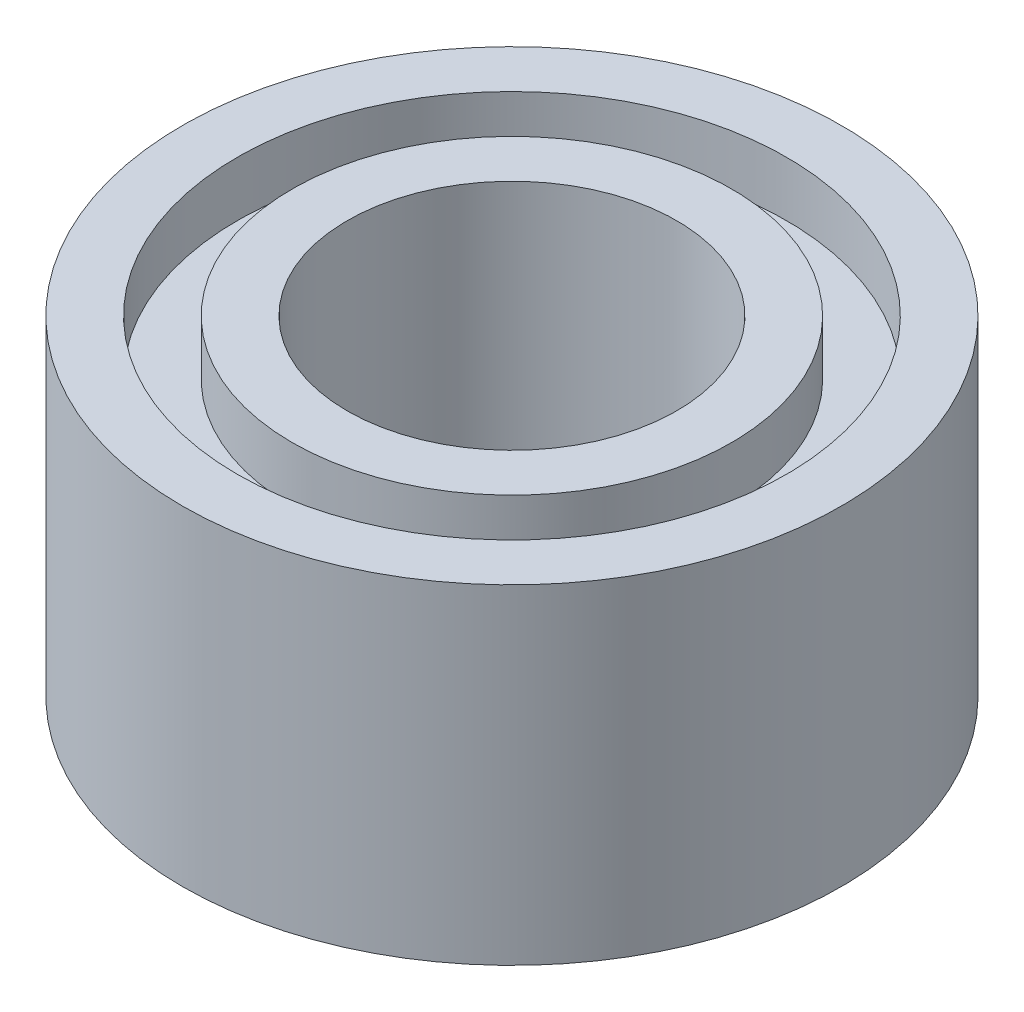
ISO-10303-21;
HEADER;
FILE_DESCRIPTION(('STEP AP214'),'2;1');
FILE_NAME('part.step','',(''),(''),'','','');
FILE_SCHEMA(('AUTOMOTIVE_DESIGN { 1 0 10303 214 1 1 1 1 }'));
ENDSEC;
DATA;
#1=APPLICATION_CONTEXT('core data for automotive mechanical design processes');
#2=APPLICATION_PROTOCOL_DEFINITION('international standard','automotive_design',2000,#1);
#3=PRODUCT_CONTEXT('',#1,'mechanical');
#4=PRODUCT('Part','Part','',(#3));
#5=PRODUCT_RELATED_PRODUCT_CATEGORY('part','',(#4));
#6=PRODUCT_DEFINITION_FORMATION('','',#4);
#7=PRODUCT_DEFINITION_CONTEXT('part definition',#1,'design');
#8=PRODUCT_DEFINITION('design','',#6,#7);
#9=PRODUCT_DEFINITION_SHAPE('','',#8);
#10=(LENGTH_UNIT() NAMED_UNIT(*) SI_UNIT(.MILLI.,.METRE.));
#11=(NAMED_UNIT(*) PLANE_ANGLE_UNIT() SI_UNIT($,.RADIAN.));
#12=(NAMED_UNIT(*) SI_UNIT($,.STERADIAN.) SOLID_ANGLE_UNIT());
#13=UNCERTAINTY_MEASURE_WITH_UNIT(LENGTH_MEASURE(1.E-05),#10,'distance_accuracy_value','');
#14=(GEOMETRIC_REPRESENTATION_CONTEXT(3) GLOBAL_UNCERTAINTY_ASSIGNED_CONTEXT((#13)) GLOBAL_UNIT_ASSIGNED_CONTEXT((#10,
#11,#12)) REPRESENTATION_CONTEXT('',''));
#15=CARTESIAN_POINT('',(0.,0.,0.));
#16=DIRECTION('',(0.,0.,1.));
#17=DIRECTION('',(1.,0.,0.));
#18=AXIS2_PLACEMENT_3D('',#15,#16,#17);
#19=CARTESIAN_POINT('',(0.,0.,0.));
#20=DIRECTION('',(0.,1.,0.));
#21=DIRECTION('',(0.,0.,1.));
#22=AXIS2_PLACEMENT_3D('',#19,#20,#21);
#23=PLANE('',#22);
#24=CARTESIAN_POINT('',(0.,0.,0.));
#25=DIRECTION('',(0.,1.,0.));
#26=DIRECTION('',(0.,0.,1.));
#27=AXIS2_PLACEMENT_3D('',#24,#25,#26);
#28=CIRCLE('',#27,1.5);
#29=CARTESIAN_POINT('',(0.,0.,1.5));
#30=VERTEX_POINT('',#29);
#31=EDGE_CURVE('E58',#30,#30,#28,.T.);
#32=ORIENTED_EDGE('',*,*,#31,.T.);
#33=EDGE_LOOP('',(#32));
#34=FACE_BOUND('',#33,.T.);
#35=CARTESIAN_POINT('',(0.,0.,0.));
#36=DIRECTION('',(0.,-1.,0.));
#37=DIRECTION('',(0.,0.,-1.));
#38=AXIS2_PLACEMENT_3D('',#35,#36,#37);
#39=CIRCLE('',#38,2.);
#40=CARTESIAN_POINT('',(0.,0.,-2.));
#41=VERTEX_POINT('',#40);
#42=EDGE_CURVE('E82',#41,#41,#39,.T.);
#43=ORIENTED_EDGE('',*,*,#42,.T.);
#44=EDGE_LOOP('',(#43));
#45=FACE_BOUND('',#44,.T.);
#46=ADVANCED_FACE('F45',(#34,#45),#23,.F.);
#47=CARTESIAN_POINT('',(0.,3.,0.));
#48=DIRECTION('',(0.,1.,0.));
#49=DIRECTION('',(0.,0.,1.));
#50=AXIS2_PLACEMENT_3D('',#47,#48,#49);
#51=PLANE('',#50);
#52=CARTESIAN_POINT('',(0.,3.,0.));
#53=DIRECTION('',(0.,1.,0.));
#54=DIRECTION('',(0.,0.,1.));
#55=AXIS2_PLACEMENT_3D('',#52,#53,#54);
#56=CIRCLE('',#55,1.5);
#57=CARTESIAN_POINT('',(0.,3.,1.5));
#58=VERTEX_POINT('',#57);
#59=EDGE_CURVE('E56',#58,#58,#56,.T.);
#60=ORIENTED_EDGE('',*,*,#59,.F.);
#61=EDGE_LOOP('',(#60));
#62=FACE_BOUND('',#61,.T.);
#63=CARTESIAN_POINT('',(0.,3.,0.));
#64=DIRECTION('',(0.,1.,0.));
#65=DIRECTION('',(0.,0.,1.));
#66=AXIS2_PLACEMENT_3D('',#63,#64,#65);
#67=CIRCLE('',#66,2.);
#68=CARTESIAN_POINT('',(0.,3.,2.));
#69=VERTEX_POINT('',#68);
#70=EDGE_CURVE('E70',#69,#69,#67,.T.);
#71=ORIENTED_EDGE('',*,*,#70,.T.);
#72=EDGE_LOOP('',(#71));
#73=FACE_BOUND('',#72,.T.);
#74=ADVANCED_FACE('F120',(#62,#73),#51,.T.);
#75=CARTESIAN_POINT('',(0.,3.,0.));
#76=DIRECTION('',(0.,1.,0.));
#77=DIRECTION('',(0.,0.,1.));
#78=AXIS2_PLACEMENT_3D('',#75,#76,#77);
#79=CIRCLE('',#78,2.5);
#80=CARTESIAN_POINT('',(0.,3.,2.5));
#81=VERTEX_POINT('',#80);
#82=EDGE_CURVE('E64',#81,#81,#79,.T.);
#83=ORIENTED_EDGE('',*,*,#82,.F.);
#84=EDGE_LOOP('',(#83));
#85=FACE_BOUND('',#84,.T.);
#86=CARTESIAN_POINT('',(0.,3.,0.));
#87=DIRECTION('',(0.,1.,0.));
#88=DIRECTION('',(0.,0.,1.));
#89=AXIS2_PLACEMENT_3D('',#86,#87,#88);
#90=CIRCLE('',#89,3.);
#91=CARTESIAN_POINT('',(0.,3.,3.));
#92=VERTEX_POINT('',#91);
#93=EDGE_CURVE('E10',#92,#92,#90,.T.);
#94=ORIENTED_EDGE('',*,*,#93,.T.);
#95=EDGE_LOOP('',(#94));
#96=FACE_BOUND('',#95,.T.);
#97=ADVANCED_FACE('F107',(#85,#96),#51,.T.);
#98=CARTESIAN_POINT('',(0.,0.,0.));
#99=DIRECTION('',(0.,-1.,0.));
#100=DIRECTION('',(0.,0.,-1.));
#101=AXIS2_PLACEMENT_3D('',#98,#99,#100);
#102=CIRCLE('',#101,2.5);
#103=CARTESIAN_POINT('',(0.,0.,-2.5));
#104=VERTEX_POINT('',#103);
#105=EDGE_CURVE('E76',#104,#104,#102,.T.);
#106=ORIENTED_EDGE('',*,*,#105,.F.);
#107=EDGE_LOOP('',(#106));
#108=FACE_BOUND('',#107,.T.);
#109=CARTESIAN_POINT('',(0.,0.,0.));
#110=DIRECTION('',(0.,1.,0.));
#111=DIRECTION('',(0.,0.,1.));
#112=AXIS2_PLACEMENT_3D('',#109,#110,#111);
#113=CIRCLE('',#112,3.);
#114=CARTESIAN_POINT('',(0.,0.,3.));
#115=VERTEX_POINT('',#114);
#116=EDGE_CURVE('E49',#115,#115,#113,.T.);
#117=ORIENTED_EDGE('',*,*,#116,.F.);
#118=EDGE_LOOP('',(#117));
#119=FACE_BOUND('',#118,.T.);
#120=ADVANCED_FACE('F104',(#108,#119),#23,.F.);
#121=CARTESIAN_POINT('',(0.,3.,0.));
#122=DIRECTION('',(0.,-1.,0.));
#123=DIRECTION('',(0.,0.,-1.));
#124=AXIS2_PLACEMENT_3D('',#121,#122,#123);
#125=CYLINDRICAL_SURFACE('',#124,3.);
#126=ORIENTED_EDGE('',*,*,#93,.F.);
#127=EDGE_LOOP('',(#126));
#128=FACE_BOUND('',#127,.T.);
#129=ORIENTED_EDGE('',*,*,#116,.T.);
#130=EDGE_LOOP('',(#129));
#131=FACE_BOUND('',#130,.T.);
#132=ADVANCED_FACE('F47',(#128,#131),#125,.T.);
#133=CARTESIAN_POINT('',(0.,3.,0.));
#134=DIRECTION('',(0.,-1.,0.));
#135=DIRECTION('',(0.,0.,-1.));
#136=AXIS2_PLACEMENT_3D('',#133,#134,#135);
#137=CYLINDRICAL_SURFACE('',#136,1.5);
#138=ORIENTED_EDGE('',*,*,#59,.T.);
#139=EDGE_LOOP('',(#138));
#140=FACE_BOUND('',#139,.T.);
#141=ORIENTED_EDGE('',*,*,#31,.F.);
#142=EDGE_LOOP('',(#141));
#143=FACE_BOUND('',#142,.T.);
#144=ADVANCED_FACE('F111',(#140,#143),#137,.F.);
#145=CARTESIAN_POINT('',(0.,2.5,0.));
#146=DIRECTION('',(0.,1.,0.));
#147=DIRECTION('',(0.,0.,1.));
#148=AXIS2_PLACEMENT_3D('',#145,#146,#147);
#149=CYLINDRICAL_SURFACE('',#148,2.5);
#150=CARTESIAN_POINT('',(0.,2.5,0.));
#151=DIRECTION('',(0.,1.,0.));
#152=DIRECTION('',(0.,0.,1.));
#153=AXIS2_PLACEMENT_3D('',#150,#151,#152);
#154=CIRCLE('',#153,2.5);
#155=CARTESIAN_POINT('',(0.,2.5,2.5));
#156=VERTEX_POINT('',#155);
#157=EDGE_CURVE('E61',#156,#156,#154,.T.);
#158=ORIENTED_EDGE('',*,*,#157,.F.);
#159=EDGE_LOOP('',(#158));
#160=FACE_BOUND('',#159,.T.);
#161=ORIENTED_EDGE('',*,*,#82,.T.);
#162=EDGE_LOOP('',(#161));
#163=FACE_BOUND('',#162,.T.);
#164=ADVANCED_FACE('F116',(#160,#163),#149,.F.);
#165=CARTESIAN_POINT('',(0.,2.5,0.));
#166=DIRECTION('',(0.,1.,0.));
#167=DIRECTION('',(0.,0.,1.));
#168=AXIS2_PLACEMENT_3D('',#165,#166,#167);
#169=PLANE('',#168);
#170=CARTESIAN_POINT('',(0.,2.5,0.));
#171=DIRECTION('',(0.,1.,0.));
#172=DIRECTION('',(0.,0.,1.));
#173=AXIS2_PLACEMENT_3D('',#170,#171,#172);
#174=CIRCLE('',#173,2.);
#175=CARTESIAN_POINT('',(0.,2.5,2.));
#176=VERTEX_POINT('',#175);
#177=EDGE_CURVE('E67',#176,#176,#174,.T.);
#178=ORIENTED_EDGE('',*,*,#177,.F.);
#179=EDGE_LOOP('',(#178));
#180=FACE_BOUND('',#179,.T.);
#181=ORIENTED_EDGE('',*,*,#157,.T.);
#182=EDGE_LOOP('',(#181));
#183=FACE_BOUND('',#182,.T.);
#184=ADVANCED_FACE('F133',(#180,#183),#169,.T.);
#185=CARTESIAN_POINT('',(0.,2.5,0.));
#186=DIRECTION('',(0.,1.,0.));
#187=DIRECTION('',(0.,0.,1.));
#188=AXIS2_PLACEMENT_3D('',#185,#186,#187);
#189=CYLINDRICAL_SURFACE('',#188,2.);
#190=ORIENTED_EDGE('',*,*,#177,.T.);
#191=EDGE_LOOP('',(#190));
#192=FACE_BOUND('',#191,.T.);
#193=ORIENTED_EDGE('',*,*,#70,.F.);
#194=EDGE_LOOP('',(#193));
#195=FACE_BOUND('',#194,.T.);
#196=ADVANCED_FACE('F100',(#192,#195),#189,.T.);
#197=CARTESIAN_POINT('',(0.,0.5,0.));
#198=DIRECTION('',(0.,-1.,0.));
#199=DIRECTION('',(0.,0.,-1.));
#200=AXIS2_PLACEMENT_3D('',#197,#198,#199);
#201=CYLINDRICAL_SURFACE('',#200,2.5);
#202=CARTESIAN_POINT('',(0.,0.5,0.));
#203=DIRECTION('',(0.,-1.,0.));
#204=DIRECTION('',(0.,0.,-1.));
#205=AXIS2_PLACEMENT_3D('',#202,#203,#204);
#206=CIRCLE('',#205,2.5);
#207=CARTESIAN_POINT('',(0.,0.5,-2.5));
#208=VERTEX_POINT('',#207);
#209=EDGE_CURVE('E73',#208,#208,#206,.T.);
#210=ORIENTED_EDGE('',*,*,#209,.F.);
#211=EDGE_LOOP('',(#210));
#212=FACE_BOUND('',#211,.T.);
#213=ORIENTED_EDGE('',*,*,#105,.T.);
#214=EDGE_LOOP('',(#213));
#215=FACE_BOUND('',#214,.T.);
#216=ADVANCED_FACE('F94',(#212,#215),#201,.F.);
#217=CARTESIAN_POINT('',(0.,0.5,0.));
#218=DIRECTION('',(0.,-1.,0.));
#219=DIRECTION('',(0.,0.,-1.));
#220=AXIS2_PLACEMENT_3D('',#217,#218,#219);
#221=PLANE('',#220);
#222=CARTESIAN_POINT('',(0.,0.5,0.));
#223=DIRECTION('',(0.,-1.,0.));
#224=DIRECTION('',(0.,0.,-1.));
#225=AXIS2_PLACEMENT_3D('',#222,#223,#224);
#226=CIRCLE('',#225,2.);
#227=CARTESIAN_POINT('',(0.,0.5,-2.));
#228=VERTEX_POINT('',#227);
#229=EDGE_CURVE('E79',#228,#228,#226,.T.);
#230=ORIENTED_EDGE('',*,*,#229,.F.);
#231=EDGE_LOOP('',(#230));
#232=FACE_BOUND('',#231,.T.);
#233=ORIENTED_EDGE('',*,*,#209,.T.);
#234=EDGE_LOOP('',(#233));
#235=FACE_BOUND('',#234,.T.);
#236=ADVANCED_FACE('F91',(#232,#235),#221,.T.);
#237=CARTESIAN_POINT('',(0.,0.5,0.));
#238=DIRECTION('',(0.,-1.,0.));
#239=DIRECTION('',(0.,0.,-1.));
#240=AXIS2_PLACEMENT_3D('',#237,#238,#239);
#241=CYLINDRICAL_SURFACE('',#240,2.);
#242=ORIENTED_EDGE('',*,*,#229,.T.);
#243=EDGE_LOOP('',(#242));
#244=FACE_BOUND('',#243,.T.);
#245=ORIENTED_EDGE('',*,*,#42,.F.);
#246=EDGE_LOOP('',(#245));
#247=FACE_BOUND('',#246,.T.);
#248=ADVANCED_FACE('F88',(#244,#247),#241,.T.);
#249=CLOSED_SHELL('',(#46,#74,#97,#120,#132,#144,#164,#184,#196,#216,#236,#248));
#250=MANIFOLD_SOLID_BREP('B2',#249);
#251=ADVANCED_BREP_SHAPE_REPRESENTATION('',(#18,#250),#14);
#252=SHAPE_DEFINITION_REPRESENTATION(#9,#251);
ENDSEC;
END-ISO-10303-21;
